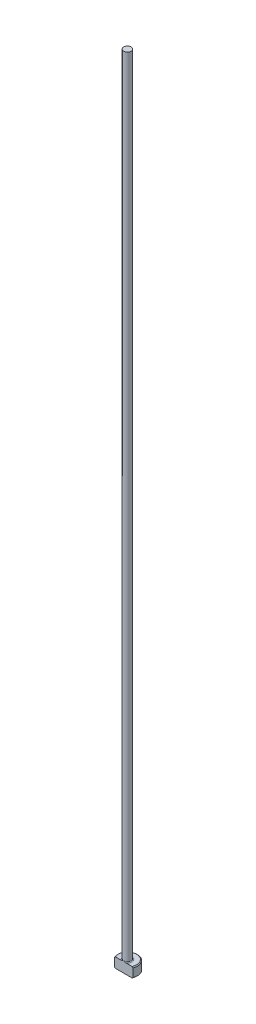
ISO-10303-21;
HEADER;
FILE_DESCRIPTION(('STEP AP214'),'2;1');
FILE_NAME('part.step','',(''),(''),'','','');
FILE_SCHEMA(('AUTOMOTIVE_DESIGN { 1 0 10303 214 1 1 1 1 }'));
ENDSEC;
DATA;
#1=APPLICATION_CONTEXT('core data for automotive mechanical design processes');
#2=APPLICATION_PROTOCOL_DEFINITION('international standard','automotive_design',2000,#1);
#3=PRODUCT_CONTEXT('',#1,'mechanical');
#4=PRODUCT('Part','Part','',(#3));
#5=PRODUCT_RELATED_PRODUCT_CATEGORY('part','',(#4));
#6=PRODUCT_DEFINITION_FORMATION('','',#4);
#7=PRODUCT_DEFINITION_CONTEXT('part definition',#1,'design');
#8=PRODUCT_DEFINITION('design','',#6,#7);
#9=PRODUCT_DEFINITION_SHAPE('','',#8);
#10=(LENGTH_UNIT() NAMED_UNIT(*) SI_UNIT(.MILLI.,.METRE.));
#11=(NAMED_UNIT(*) PLANE_ANGLE_UNIT() SI_UNIT($,.RADIAN.));
#12=(NAMED_UNIT(*) SI_UNIT($,.STERADIAN.) SOLID_ANGLE_UNIT());
#13=UNCERTAINTY_MEASURE_WITH_UNIT(LENGTH_MEASURE(1.E-05),#10,'distance_accuracy_value','');
#14=(GEOMETRIC_REPRESENTATION_CONTEXT(3) GLOBAL_UNCERTAINTY_ASSIGNED_CONTEXT((#13)) GLOBAL_UNIT_ASSIGNED_CONTEXT((#10,
#11,#12)) REPRESENTATION_CONTEXT('',''));
#15=CARTESIAN_POINT('',(0.,0.,0.));
#16=DIRECTION('',(0.,0.,1.));
#17=DIRECTION('',(1.,0.,0.));
#18=AXIS2_PLACEMENT_3D('',#15,#16,#17);
#19=CARTESIAN_POINT('',(0.,0.,0.));
#20=DIRECTION('',(0.,-1.,0.));
#21=DIRECTION('',(0.,0.,-1.));
#22=AXIS2_PLACEMENT_3D('',#19,#20,#21);
#23=PLANE('',#22);
#24=CARTESIAN_POINT('',(0.,0.,0.));
#25=DIRECTION('',(0.,-1.,0.));
#26=DIRECTION('',(0.,0.,-1.));
#27=AXIS2_PLACEMENT_3D('',#24,#25,#26);
#28=CIRCLE('',#27,2.92099999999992);
#29=CARTESIAN_POINT('',(-2.66761406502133,0.,1.18998999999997));
#30=VERTEX_POINT('',#29);
#31=CARTESIAN_POINT('',(2.66761406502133,0.,1.18998999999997));
#32=VERTEX_POINT('',#31);
#33=EDGE_CURVE('E98',#30,#32,#28,.T.);
#34=ORIENTED_EDGE('',*,*,#33,.T.);
#35=DIRECTION('',(-1.,0.,0.));
#36=VECTOR('',#35,1.);
#37=CARTESIAN_POINT('',(-2.94356056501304,0.,1.18998999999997));
#38=LINE('',#37,#36);
#39=EDGE_CURVE('E83',#32,#30,#38,.T.);
#40=ORIENTED_EDGE('',*,*,#39,.T.);
#41=EDGE_LOOP('',(#34,#40));
#42=FACE_BOUND('',#41,.T.);
#43=ADVANCED_FACE('F32',(#42),#23,.T.);
#44=CARTESIAN_POINT('',(0.,259.958771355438,0.));
#45=DIRECTION('',(0.,1.,0.));
#46=DIRECTION('',(0.,0.,1.));
#47=AXIS2_PLACEMENT_3D('',#44,#45,#46);
#48=CYLINDRICAL_SURFACE('',#47,3.17499999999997);
#49=CARTESIAN_POINT('',(0.,2.92100000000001,0.));
#50=DIRECTION('',(0.,1.,0.));
#51=DIRECTION('',(0.,0.,1.));
#52=AXIS2_PLACEMENT_3D('',#49,#50,#51);
#53=CIRCLE('',#52,3.17499999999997);
#54=CARTESIAN_POINT('',(-2.94356056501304,2.92100000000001,1.18998999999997));
#55=VERTEX_POINT('',#54);
#56=CARTESIAN_POINT('',(2.94356056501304,2.92100000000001,1.18998999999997));
#57=VERTEX_POINT('',#56);
#58=EDGE_CURVE('E104',#55,#57,#53,.F.);
#59=ORIENTED_EDGE('',*,*,#58,.T.);
#60=DIRECTION('',(0.,-1.,0.));
#61=VECTOR('',#60,1.);
#62=CARTESIAN_POINT('',(2.94356056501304,254.,1.18998999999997));
#63=LINE('',#62,#61);
#64=CARTESIAN_POINT('',(2.94356056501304,0.254000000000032,1.18998999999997));
#65=VERTEX_POINT('',#64);
#66=EDGE_CURVE('E183',#57,#65,#63,.T.);
#67=ORIENTED_EDGE('',*,*,#66,.T.);
#68=CARTESIAN_POINT('',(0.,0.254000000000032,0.));
#69=DIRECTION('',(0.,-1.,0.));
#70=DIRECTION('',(0.,0.,-1.));
#71=AXIS2_PLACEMENT_3D('',#68,#69,#70);
#72=CIRCLE('',#71,3.17499999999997);
#73=CARTESIAN_POINT('',(-2.94356056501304,0.254000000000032,1.18998999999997));
#74=VERTEX_POINT('',#73);
#75=EDGE_CURVE('E100',#65,#74,#72,.F.);
#76=ORIENTED_EDGE('',*,*,#75,.T.);
#77=DIRECTION('',(0.,-1.,0.));
#78=VECTOR('',#77,1.);
#79=CARTESIAN_POINT('',(-2.94356056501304,254.,1.18998999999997));
#80=LINE('',#79,#78);
#81=EDGE_CURVE('E93',#55,#74,#80,.T.);
#82=ORIENTED_EDGE('',*,*,#81,.F.);
#83=EDGE_LOOP('',(#59,#67,#76,#82));
#84=FACE_BOUND('',#83,.T.);
#85=ADVANCED_FACE('F158',(#84),#48,.T.);
#86=CARTESIAN_POINT('',(-3.17499999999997,3.175,0.));
#87=DIRECTION('',(0.,1.,0.));
#88=DIRECTION('',(0.,0.,1.));
#89=AXIS2_PLACEMENT_3D('',#86,#87,#88);
#90=PLANE('',#89);
#91=CARTESIAN_POINT('',(0.,3.175,0.));
#92=DIRECTION('',(0.,1.,0.));
#93=DIRECTION('',(0.,0.,1.));
#94=AXIS2_PLACEMENT_3D('',#91,#92,#93);
#95=CIRCLE('',#94,2.92099999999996);
#96=CARTESIAN_POINT('',(2.66761406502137,3.175,1.18998999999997));
#97=VERTEX_POINT('',#96);
#98=CARTESIAN_POINT('',(-2.66761406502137,3.175,1.18998999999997));
#99=VERTEX_POINT('',#98);
#100=EDGE_CURVE('E178',#97,#99,#95,.T.);
#101=ORIENTED_EDGE('',*,*,#100,.T.);
#102=DIRECTION('',(1.,0.,0.));
#103=VECTOR('',#102,1.);
#104=CARTESIAN_POINT('',(-3.17499999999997,3.175,1.18998999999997));
#105=LINE('',#104,#103);
#106=CARTESIAN_POINT('',(-0.817943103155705,3.17500000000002,1.18998999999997));
#107=VERTEX_POINT('',#106);
#108=EDGE_CURVE('E57',#99,#107,#105,.T.);
#109=ORIENTED_EDGE('',*,*,#108,.T.);
#110=CARTESIAN_POINT('',(0.,3.175,0.));
#111=DIRECTION('',(0.,1.,0.));
#112=DIRECTION('',(0.,0.,1.));
#113=AXIS2_PLACEMENT_3D('',#110,#111,#112);
#114=CIRCLE('',#113,1.44398999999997);
#115=CARTESIAN_POINT('',(0.817943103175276,3.17500000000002,1.18998999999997));
#116=VERTEX_POINT('',#115);
#117=EDGE_CURVE('E107',#107,#116,#114,.F.);
#118=ORIENTED_EDGE('',*,*,#117,.T.);
#119=EDGE_CURVE('E136',#116,#97,#105,.T.);
#120=ORIENTED_EDGE('',*,*,#119,.T.);
#121=EDGE_LOOP('',(#101,#109,#118,#120));
#122=FACE_BOUND('',#121,.T.);
#123=ADVANCED_FACE('F147',(#122),#90,.T.);
#124=CARTESIAN_POINT('',(0.,3.17499999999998,0.));
#125=DIRECTION('',(0.,-1.,0.));
#126=DIRECTION('',(0.,0.,-1.));
#127=AXIS2_PLACEMENT_3D('',#124,#125,#126);
#128=CONICAL_SURFACE('',#127,2.92099999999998,0.785398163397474);
#129=ORIENTED_EDGE('',*,*,#58,.F.);
#130=CARTESIAN_POINT('',(-6.47931936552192,-0.49168970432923,1.18998999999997));
#131=CARTESIAN_POINT('',(-6.3057518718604,-0.3209865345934,1.18998999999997));
#132=CARTESIAN_POINT('',(-6.13208094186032,-0.150388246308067,1.18998999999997));
#133=CARTESIAN_POINT('',(-5.78425276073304,0.190708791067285,1.18998999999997));
#134=CARTESIAN_POINT('',(-5.610095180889,0.361207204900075,1.18998999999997));
#135=CARTESIAN_POINT('',(-5.25789988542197,0.705253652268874,1.18998999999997));
#136=CARTESIAN_POINT('',(-5.07985463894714,0.878793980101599,1.18998999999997));
#137=CARTESIAN_POINT('',(-4.72344726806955,1.22514212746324,1.18998999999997));
#138=CARTESIAN_POINT('',(-4.54508573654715,1.39795055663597,1.18998999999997));
#139=CARTESIAN_POINT('',(-4.22178053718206,1.709878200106,1.18998999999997));
#140=CARTESIAN_POINT('',(-4.07696186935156,1.84912689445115,1.18998999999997));
#141=CARTESIAN_POINT('',(-3.78666752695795,2.12697558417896,1.18998999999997));
#142=CARTESIAN_POINT('',(-3.64119177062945,2.26557549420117,1.18998999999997));
#143=CARTESIAN_POINT('',(-3.34872942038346,2.54243487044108,1.18998999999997));
#144=CARTESIAN_POINT('',(-3.20173902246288,2.68069032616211,1.18998999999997));
#145=CARTESIAN_POINT('',(-2.90653907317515,2.95574973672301,1.18998999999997));
#146=CARTESIAN_POINT('',(-2.75833015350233,3.09255436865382,1.18998999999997));
#147=CARTESIAN_POINT('',(-2.46256150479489,3.36167470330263,1.18998999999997));
#148=CARTESIAN_POINT('',(-2.3150353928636,3.49402709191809,1.18998999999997));
#149=CARTESIAN_POINT('',(-2.09131974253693,3.69008529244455,1.18998999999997));
#150=CARTESIAN_POINT('',(-2.01626900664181,3.75508852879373,1.18998999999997));
#151=CARTESIAN_POINT('',(-1.86516644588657,3.88390741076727,1.18998999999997));
#152=CARTESIAN_POINT('',(-1.78911473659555,3.94772319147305,1.18998999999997));
#153=CARTESIAN_POINT('',(-1.63628476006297,4.07322581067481,1.18998999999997));
#154=CARTESIAN_POINT('',(-1.55951715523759,4.13492558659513,1.18998999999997));
#155=CARTESIAN_POINT('',(-1.40419805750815,4.25603341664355,1.18998999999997));
#156=CARTESIAN_POINT('',(-1.32564684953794,4.31544183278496,1.18998999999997));
#157=CARTESIAN_POINT('',(-1.16630337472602,4.43067355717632,1.18998999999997));
#158=CARTESIAN_POINT('',(-1.0855185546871,4.48650710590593,1.18998999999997));
#159=CARTESIAN_POINT('',(-0.920537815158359,4.59284659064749,1.18998999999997));
#160=CARTESIAN_POINT('',(-0.836346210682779,4.64335899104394,1.18998999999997));
#161=CARTESIAN_POINT('',(-0.730888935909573,4.69956746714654,1.18998999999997));
#162=CARTESIAN_POINT('',(-0.71184810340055,4.70944634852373,1.18998999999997));
#163=CARTESIAN_POINT('',(-0.673521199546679,4.72872851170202,1.18998999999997));
#164=CARTESIAN_POINT('',(-0.654235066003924,4.73813166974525,1.18998999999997));
#165=CARTESIAN_POINT('',(-0.59599952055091,4.7655420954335,1.18998999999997));
#166=CARTESIAN_POINT('',(-0.556668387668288,4.78275278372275,1.18998999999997));
#167=CARTESIAN_POINT('',(-0.477355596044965,4.81434640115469,1.18998999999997));
#168=CARTESIAN_POINT('',(-0.437385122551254,4.82875715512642,1.18998999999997));
#169=CARTESIAN_POINT('',(-0.356410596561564,4.85437528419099,1.18998999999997));
#170=CARTESIAN_POINT('',(-0.31540652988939,4.86558261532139,1.18998999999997));
#171=CARTESIAN_POINT('',(-0.239749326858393,4.88255703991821,1.18998999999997));
#172=CARTESIAN_POINT('',(-0.205233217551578,4.88893154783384,1.18998999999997));
#173=CARTESIAN_POINT('',(-0.135794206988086,4.89877967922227,1.18998999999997));
#174=CARTESIAN_POINT('',(-0.100871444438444,4.90225426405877,1.18998999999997));
#175=CARTESIAN_POINT('',(-0.0309424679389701,4.9061183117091,1.18998999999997));
#176=CARTESIAN_POINT('',(0.00406330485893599,4.90651563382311,1.18998999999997));
#177=CARTESIAN_POINT('',(0.0739860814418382,4.90422492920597,1.18998999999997));
#178=CARTESIAN_POINT('',(0.108903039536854,4.90153554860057,1.18998999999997));
#179=CARTESIAN_POINT('',(0.185811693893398,4.89231772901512,1.18998999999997));
#180=CARTESIAN_POINT('',(0.227719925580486,4.88509144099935,1.18998999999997));
#181=CARTESIAN_POINT('',(0.310690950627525,4.86678744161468,1.18998999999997));
#182=CARTESIAN_POINT('',(0.351753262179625,4.85570759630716,1.18998999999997));
#183=CARTESIAN_POINT('',(0.433130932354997,4.83023017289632,1.18998999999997));
#184=CARTESIAN_POINT('',(0.473439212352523,4.81581030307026,1.18998999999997));
#185=CARTESIAN_POINT('',(0.552977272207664,4.78431092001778,1.18998999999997));
#186=CARTESIAN_POINT('',(0.592207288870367,4.76723199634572,1.18998999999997));
#187=CARTESIAN_POINT('',(0.705140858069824,4.71434057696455,1.18998999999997));
#188=CARTESIAN_POINT('',(0.777512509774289,4.67569611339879,1.18998999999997));
#189=CARTESIAN_POINT('',(0.919347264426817,4.59335368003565,1.18998999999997));
#190=CARTESIAN_POINT('',(0.988806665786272,4.5496495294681,1.18998999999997));
#191=CARTESIAN_POINT('',(1.12574256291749,4.4587011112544,1.18998999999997));
#192=CARTESIAN_POINT('',(1.19321018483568,4.41144359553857,1.18998999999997));
#193=CARTESIAN_POINT('',(1.32639871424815,4.31461731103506,1.18998999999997));
#194=CARTESIAN_POINT('',(1.39212046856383,4.26504969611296,1.18998999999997));
#195=CARTESIAN_POINT('',(1.52321682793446,4.16350825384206,1.18998999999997));
#196=CARTESIAN_POINT('',(1.58857229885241,4.11150983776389,1.18998999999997));
#197=CARTESIAN_POINT('',(1.71826265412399,4.00624640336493,1.18998999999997));
#198=CARTESIAN_POINT('',(1.78259742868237,3.95298125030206,1.18998999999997));
#199=CARTESIAN_POINT('',(1.9103046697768,3.84563387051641,1.18998999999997));
#200=CARTESIAN_POINT('',(1.97367914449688,3.79155402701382,1.18998999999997));
#201=CARTESIAN_POINT('',(2.09979151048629,3.68266386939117,1.18998999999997));
#202=CARTESIAN_POINT('',(2.1625294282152,3.62785358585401,1.18998999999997));
#203=CARTESIAN_POINT('',(2.32034022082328,3.48869772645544,1.18998999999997));
#204=CARTESIAN_POINT('',(2.41507621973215,3.40397040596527,1.18998999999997));
#205=CARTESIAN_POINT('',(2.60367921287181,3.23355294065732,1.18998999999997));
#206=CARTESIAN_POINT('',(2.69754618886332,3.14786277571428,1.18998999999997));
#207=CARTESIAN_POINT('',(2.97818594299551,2.88972120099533,1.18998999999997));
#208=CARTESIAN_POINT('',(3.1639838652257,2.71621092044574,1.18998999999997));
#209=CARTESIAN_POINT('',(3.53424564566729,2.36730235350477,1.18998999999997));
#210=CARTESIAN_POINT('',(3.71870746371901,2.19190191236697,1.18998999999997));
#211=CARTESIAN_POINT('',(4.08658256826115,1.84002104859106,1.18998999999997));
#212=CARTESIAN_POINT('',(4.26999589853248,1.6635406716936,1.18998999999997));
#213=CARTESIAN_POINT('',(4.62290911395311,1.32258886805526,1.18998999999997));
#214=CARTESIAN_POINT('',(4.79245879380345,1.15816891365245,1.18998999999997));
#215=CARTESIAN_POINT('',(5.13110594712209,0.828859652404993,1.18998999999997));
#216=CARTESIAN_POINT('',(5.30020341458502,0.663970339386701,1.18998999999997));
#217=CARTESIAN_POINT('',(5.63778854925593,0.334103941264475,1.18998999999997));
#218=CARTESIAN_POINT('',(5.80627675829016,0.169127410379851,1.18998999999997));
#219=CARTESIAN_POINT('',(6.14298232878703,-0.161096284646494,1.18998999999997));
#220=CARTESIAN_POINT('',(6.31119969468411,-0.32634344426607,1.18998999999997));
#221=CARTESIAN_POINT('',(6.47931936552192,-0.49168970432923,1.18998999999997));
#222=B_SPLINE_CURVE_WITH_KNOTS('',3,(#130,#131,#132,#133,#134,#135,#136,#137,#138,#139,#140,
#141,#142,#143,#144,#145,#146,#147,#148,#149,#150,#151,#152,#153,#154,#155,#156,#157,#158,#159,
#160,#161,#162,#163,#164,#165,#166,#167,#168,#169,#170,#171,#172,#173,#174,#175,#176,#177,#178,
#179,#180,#181,#182,#183,#184,#185,#186,#187,#188,#189,#190,#191,#192,#193,#194,#195,#196,#197,
#198,#199,#200,#201,#202,#203,#204,#205,#206,#207,#208,#209,#210,#211,#212,#213,#214,#215,#216,
#217,#218,#219,#220,#221),.UNSPECIFIED.,.F.,.F.,(4,2,2,2,2,2,2,2,2,2,2,2,2,2,2,2,2,2,2,2,2,2,2,
2,2,2,2,2,2,2,2,2,2,2,2,2,2,2,2,2,2,2,2,2,2,4),(0.,0.730333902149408,1.46150049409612,
2.20738656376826,2.95242206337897,3.55513421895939,4.15792356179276,4.76329855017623,
5.3683773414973,5.96292222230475,6.26077664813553,6.55859698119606,6.85403741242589,
7.14943097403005,7.44393654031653,7.7380800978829,7.80242723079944,7.866791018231,
7.99550301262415,8.12286192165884,8.25022257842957,8.35541203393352,8.46056660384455,
8.56545252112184,8.67038446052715,8.79775050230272,8.92518718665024,9.05350023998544,
9.18178488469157,9.4275558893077,9.67363035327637,9.92067269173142,10.1675929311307,
10.4181243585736,10.6686825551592,10.9186125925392,11.1685321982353,11.5498128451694,
11.9311014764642,12.6937337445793,13.4573540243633,14.2209421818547,14.9294812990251,
15.638029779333,16.3454542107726,17.0528669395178),.UNSPECIFIED.);
#223=EDGE_CURVE('E135',#55,#99,#222,.T.);
#224=ORIENTED_EDGE('',*,*,#223,.T.);
#225=ORIENTED_EDGE('',*,*,#100,.F.);
#226=EDGE_CURVE('E127',#97,#57,#222,.T.);
#227=ORIENTED_EDGE('',*,*,#226,.T.);
#228=EDGE_LOOP('',(#129,#224,#225,#227));
#229=FACE_BOUND('',#228,.T.);
#230=ADVANCED_FACE('F143',(#229),#128,.T.);
#231=CARTESIAN_POINT('',(0.,0.254000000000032,0.));
#232=DIRECTION('',(0.,1.,0.));
#233=DIRECTION('',(0.,0.,1.));
#234=AXIS2_PLACEMENT_3D('',#231,#232,#233);
#235=CONICAL_SURFACE('',#234,3.17499999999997,0.785398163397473);
#236=ORIENTED_EDGE('',*,*,#75,.F.);
#237=CARTESIAN_POINT('',(6.47931936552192,3.66668970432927,1.18998999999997));
#238=CARTESIAN_POINT('',(6.3057518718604,3.49598653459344,1.18998999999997));
#239=CARTESIAN_POINT('',(6.13208094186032,3.32538824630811,1.18998999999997));
#240=CARTESIAN_POINT('',(5.78425276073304,2.98429120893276,1.18998999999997));
#241=CARTESIAN_POINT('',(5.610095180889,2.81379279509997,1.18998999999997));
#242=CARTESIAN_POINT('',(5.25789988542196,2.46974634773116,1.18998999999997));
#243=CARTESIAN_POINT('',(5.07985463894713,2.29620601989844,1.18998999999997));
#244=CARTESIAN_POINT('',(4.72344726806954,1.9498578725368,1.18998999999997));
#245=CARTESIAN_POINT('',(4.54508573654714,1.77704944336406,1.18998999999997));
#246=CARTESIAN_POINT('',(4.22178053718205,1.46512179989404,1.18998999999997));
#247=CARTESIAN_POINT('',(4.07696186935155,1.32587310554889,1.18998999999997));
#248=CARTESIAN_POINT('',(3.78666752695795,1.04802441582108,1.18998999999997));
#249=CARTESIAN_POINT('',(3.64119177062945,0.909424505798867,1.18998999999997));
#250=CARTESIAN_POINT('',(3.34872942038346,0.632565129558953,1.18998999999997));
#251=CARTESIAN_POINT('',(3.20173902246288,0.494309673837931,1.18998999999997));
#252=CARTESIAN_POINT('',(2.90653907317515,0.219250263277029,1.18998999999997));
#253=CARTESIAN_POINT('',(2.75833015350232,0.0824456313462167,1.18998999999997));
#254=CARTESIAN_POINT('',(2.46256150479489,-0.186674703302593,1.18998999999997));
#255=CARTESIAN_POINT('',(2.3150353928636,-0.319027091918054,1.18998999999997));
#256=CARTESIAN_POINT('',(2.09131974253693,-0.515085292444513,1.18998999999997));
#257=CARTESIAN_POINT('',(2.01626900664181,-0.580088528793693,1.18998999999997));
#258=CARTESIAN_POINT('',(1.86516644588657,-0.708907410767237,1.18998999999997));
#259=CARTESIAN_POINT('',(1.78911473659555,-0.77272319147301,1.18998999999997));
#260=CARTESIAN_POINT('',(1.63628476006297,-0.898225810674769,1.18998999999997));
#261=CARTESIAN_POINT('',(1.55951715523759,-0.959925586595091,1.18998999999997));
#262=CARTESIAN_POINT('',(1.40419805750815,-1.08103341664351,1.18998999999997));
#263=CARTESIAN_POINT('',(1.32564684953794,-1.14044183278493,1.18998999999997));
#264=CARTESIAN_POINT('',(1.16630337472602,-1.25567355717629,1.18998999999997));
#265=CARTESIAN_POINT('',(1.0855185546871,-1.31150710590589,1.18998999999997));
#266=CARTESIAN_POINT('',(0.920537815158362,-1.41784659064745,1.18998999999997));
#267=CARTESIAN_POINT('',(0.836346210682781,-1.4683589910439,1.18998999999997));
#268=CARTESIAN_POINT('',(0.730888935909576,-1.5245674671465,1.18998999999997));
#269=CARTESIAN_POINT('',(0.711848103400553,-1.53444634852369,1.18998999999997));
#270=CARTESIAN_POINT('',(0.673521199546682,-1.55372851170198,1.18998999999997));
#271=CARTESIAN_POINT('',(0.654235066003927,-1.56313166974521,1.18998999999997));
#272=CARTESIAN_POINT('',(0.595999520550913,-1.59054209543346,1.18998999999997));
#273=CARTESIAN_POINT('',(0.556668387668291,-1.60775278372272,1.18998999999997));
#274=CARTESIAN_POINT('',(0.477355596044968,-1.63934640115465,1.18998999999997));
#275=CARTESIAN_POINT('',(0.437385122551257,-1.65375715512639,1.18998999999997));
#276=CARTESIAN_POINT('',(0.356410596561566,-1.67937528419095,1.18998999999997));
#277=CARTESIAN_POINT('',(0.315406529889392,-1.69058261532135,1.18998999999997));
#278=CARTESIAN_POINT('',(0.239749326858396,-1.70755703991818,1.18998999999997));
#279=CARTESIAN_POINT('',(0.205233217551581,-1.7139315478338,1.18998999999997));
#280=CARTESIAN_POINT('',(0.13579420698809,-1.72377967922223,1.18998999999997));
#281=CARTESIAN_POINT('',(0.100871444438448,-1.72725426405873,1.18998999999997));
#282=CARTESIAN_POINT('',(0.0309424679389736,-1.73111831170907,1.18998999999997));
#283=CARTESIAN_POINT('',(-0.00406330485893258,-1.73151563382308,1.18998999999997));
#284=CARTESIAN_POINT('',(-0.073986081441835,-1.72922492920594,1.18998999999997));
#285=CARTESIAN_POINT('',(-0.108903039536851,-1.72653554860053,1.18998999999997));
#286=CARTESIAN_POINT('',(-0.185811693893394,-1.71731772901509,1.18998999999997));
#287=CARTESIAN_POINT('',(-0.227719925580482,-1.71009144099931,1.18998999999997));
#288=CARTESIAN_POINT('',(-0.31069095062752,-1.69178744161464,1.18998999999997));
#289=CARTESIAN_POINT('',(-0.351753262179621,-1.68070759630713,1.18998999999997));
#290=CARTESIAN_POINT('',(-0.433130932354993,-1.65523017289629,1.18998999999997));
#291=CARTESIAN_POINT('',(-0.473439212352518,-1.64081030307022,1.18998999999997));
#292=CARTESIAN_POINT('',(-0.55297727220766,-1.60931092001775,1.18998999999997));
#293=CARTESIAN_POINT('',(-0.592207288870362,-1.59223199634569,1.18998999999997));
#294=CARTESIAN_POINT('',(-0.705140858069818,-1.53934057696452,1.18998999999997));
#295=CARTESIAN_POINT('',(-0.777512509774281,-1.50069611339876,1.18998999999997));
#296=CARTESIAN_POINT('',(-0.919347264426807,-1.41835368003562,1.18998999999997));
#297=CARTESIAN_POINT('',(-0.988806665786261,-1.37464952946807,1.18998999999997));
#298=CARTESIAN_POINT('',(-1.12574256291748,-1.28370111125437,1.18998999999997));
#299=CARTESIAN_POINT('',(-1.19321018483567,-1.23644359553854,1.18998999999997));
#300=CARTESIAN_POINT('',(-1.32639871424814,-1.13961731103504,1.18998999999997));
#301=CARTESIAN_POINT('',(-1.39212046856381,-1.09004969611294,1.18998999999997));
#302=CARTESIAN_POINT('',(-1.52321682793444,-0.988508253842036,1.18998999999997));
#303=CARTESIAN_POINT('',(-1.58857229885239,-0.936509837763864,1.18998999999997));
#304=CARTESIAN_POINT('',(-1.71826265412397,-0.831246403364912,1.18998999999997));
#305=CARTESIAN_POINT('',(-1.78259742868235,-0.777981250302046,1.18998999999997));
#306=CARTESIAN_POINT('',(-1.91030466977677,-0.670633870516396,1.18998999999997));
#307=CARTESIAN_POINT('',(-1.97367914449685,-0.616554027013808,1.18998999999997));
#308=CARTESIAN_POINT('',(-2.09979151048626,-0.507663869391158,1.18998999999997));
#309=CARTESIAN_POINT('',(-2.16252942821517,-0.452853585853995,1.18998999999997));
#310=CARTESIAN_POINT('',(-2.32034022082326,-0.313697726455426,1.18998999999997));
#311=CARTESIAN_POINT('',(-2.41507621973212,-0.228970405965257,1.18998999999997));
#312=CARTESIAN_POINT('',(-2.60367921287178,-0.0585529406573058,1.18998999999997));
#313=CARTESIAN_POINT('',(-2.69754618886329,0.0271372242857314,1.18998999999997));
#314=CARTESIAN_POINT('',(-2.97818594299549,0.28527879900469,1.18998999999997));
#315=CARTESIAN_POINT('',(-3.16398386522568,0.458789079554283,1.18998999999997));
#316=CARTESIAN_POINT('',(-3.53424564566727,0.80769764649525,1.18998999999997));
#317=CARTESIAN_POINT('',(-3.71870746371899,0.98309808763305,1.18998999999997));
#318=CARTESIAN_POINT('',(-4.08658256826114,1.33497895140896,1.18998999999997));
#319=CARTESIAN_POINT('',(-4.26999589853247,1.51145932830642,1.18998999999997));
#320=CARTESIAN_POINT('',(-4.6229091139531,1.85241113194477,1.18998999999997));
#321=CARTESIAN_POINT('',(-4.79245879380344,2.01683108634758,1.18998999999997));
#322=CARTESIAN_POINT('',(-5.13110594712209,2.34614034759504,1.18998999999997));
#323=CARTESIAN_POINT('',(-5.30020341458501,2.51102966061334,1.18998999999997));
#324=CARTESIAN_POINT('',(-5.63778854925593,2.84089605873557,1.18998999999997));
#325=CARTESIAN_POINT('',(-5.80627675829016,3.00587258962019,1.18998999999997));
#326=CARTESIAN_POINT('',(-6.14298232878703,3.33609628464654,1.18998999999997));
#327=CARTESIAN_POINT('',(-6.31119969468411,3.50134344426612,1.18998999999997));
#328=CARTESIAN_POINT('',(-6.47931936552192,3.66668970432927,1.18998999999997));
#329=B_SPLINE_CURVE_WITH_KNOTS('',3,(#237,#238,#239,#240,#241,#242,#243,#244,#245,#246,#247,
#248,#249,#250,#251,#252,#253,#254,#255,#256,#257,#258,#259,#260,#261,#262,#263,#264,#265,#266,
#267,#268,#269,#270,#271,#272,#273,#274,#275,#276,#277,#278,#279,#280,#281,#282,#283,#284,#285,
#286,#287,#288,#289,#290,#291,#292,#293,#294,#295,#296,#297,#298,#299,#300,#301,#302,#303,#304,
#305,#306,#307,#308,#309,#310,#311,#312,#313,#314,#315,#316,#317,#318,#319,#320,#321,#322,#323,
#324,#325,#326,#327,#328),.UNSPECIFIED.,.F.,.F.,(4,2,2,2,2,2,2,2,2,2,2,2,2,2,2,2,2,2,2,2,2,2,2,
2,2,2,2,2,2,2,2,2,2,2,2,2,2,2,2,2,2,2,2,2,2,4),(0.,0.730333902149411,1.46150049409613,
2.20738656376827,2.95242206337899,3.5551342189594,4.15792356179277,4.76329855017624,
5.36837734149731,5.96292222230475,6.26077664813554,6.55859698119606,6.85403741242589,
7.14943097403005,7.44393654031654,7.7380800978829,7.80242723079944,7.866791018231,
7.99550301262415,8.12286192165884,8.25022257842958,8.35541203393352,8.46056660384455,
8.56545252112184,8.67038446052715,8.79775050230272,8.92518718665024,9.05350023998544,
9.18178488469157,9.42755588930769,9.67363035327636,9.92067269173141,10.1675929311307,
10.4181243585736,10.6686825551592,10.9186125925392,11.1685321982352,11.5498128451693,
11.9311014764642,12.6937337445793,13.4573540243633,14.2209421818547,14.9294812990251,
15.638029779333,16.3454542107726,17.0528669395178),.UNSPECIFIED.);
#330=EDGE_CURVE('E86',#65,#32,#329,.T.);
#331=ORIENTED_EDGE('',*,*,#330,.T.);
#332=ORIENTED_EDGE('',*,*,#33,.F.);
#333=EDGE_CURVE('E89',#30,#74,#329,.T.);
#334=ORIENTED_EDGE('',*,*,#333,.T.);
#335=EDGE_LOOP('',(#236,#331,#332,#334));
#336=FACE_BOUND('',#335,.T.);
#337=ADVANCED_FACE('F97',(#336),#235,.T.);
#338=CARTESIAN_POINT('',(0.,3.42900000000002,0.));
#339=DIRECTION('',(0.,1.,0.));
#340=DIRECTION('',(0.,0.,1.));
#341=AXIS2_PLACEMENT_3D('',#338,#339,#340);
#342=TOROIDAL_SURFACE('',#341,1.44398999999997,0.254);
#343=CARTESIAN_POINT('',(0.,3.42900000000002,1.18998999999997));
#344=CARTESIAN_POINT('',(1.26788799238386E-12,3.42900058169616,1.18998999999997));
#345=CARTESIAN_POINT('',(1.02037080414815E-07,3.42900116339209,1.18998999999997));
#346=CARTESIAN_POINT('',(4.36423738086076E-07,3.42900229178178,1.18998999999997));
#347=CARTESIAN_POINT('',(6.7104077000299E-07,3.42900283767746,1.18998999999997));
#348=CARTESIAN_POINT('',(1.23856841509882E-06,3.42900392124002,1.18998999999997));
#349=CARTESIAN_POINT('',(1.57695860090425E-06,3.42900445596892,1.18998999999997));
#350=CARTESIAN_POINT('',(2.31458772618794E-06,3.42900547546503,1.18998999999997));
#351=CARTESIAN_POINT('',(2.71349856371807E-06,3.42900596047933,1.18998999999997));
#352=CARTESIAN_POINT('',(4.11884078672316E-06,3.42900754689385,1.18998999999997));
#353=CARTESIAN_POINT('',(5.20568846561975E-06,3.42900857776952,1.18998999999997));
#354=CARTESIAN_POINT('',(7.47790847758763E-06,3.4290104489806,1.18998999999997));
#355=CARTESIAN_POINT('',(8.65996322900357E-06,3.4290112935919,1.18998999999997));
#356=CARTESIAN_POINT('',(1.31663854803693E-05,3.42901436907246,1.18998999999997));
#357=CARTESIAN_POINT('',(1.6609768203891E-05,3.42901643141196,1.18998999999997));
#358=CARTESIAN_POINT('',(2.34843039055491E-05,3.42901989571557,1.18998999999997));
#359=CARTESIAN_POINT('',(2.68971573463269E-05,3.42902133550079,1.18998999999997));
#360=CARTESIAN_POINT('',(4.11260389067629E-05,3.42902727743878,1.18998999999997));
#361=CARTESIAN_POINT('',(5.19833878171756E-05,3.42903166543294,1.18998999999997));
#362=CARTESIAN_POINT('',(7.24910575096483E-05,3.42903888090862,1.18998999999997));
#363=CARTESIAN_POINT('',(8.20928106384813E-05,3.42904184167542,1.18998999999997));
#364=CARTESIAN_POINT('',(0.000150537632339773,3.42906480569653,1.18998999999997));
#365=CARTESIAN_POINT('',(0.000206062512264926,3.42909344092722,1.18998999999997));
#366=CARTESIAN_POINT('',(0.000420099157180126,3.42919967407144,1.18998999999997));
#367=CARTESIAN_POINT('',(0.000580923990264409,3.42927086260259,1.18998999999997));
#368=CARTESIAN_POINT('',(0.0011986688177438,3.42954850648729,1.18998999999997));
#369=CARTESIAN_POINT('',(0.00165320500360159,3.42976167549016,1.18998999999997));
#370=CARTESIAN_POINT('',(0.00349115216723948,3.43061934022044,1.18998999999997));
#371=CARTESIAN_POINT('',(0.00487719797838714,3.43125630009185,1.18998999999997));
#372=CARTESIAN_POINT('',(0.0272455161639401,3.44154091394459,1.18998999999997));
#373=CARTESIAN_POINT('',(0.0482060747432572,3.45125229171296,1.18998999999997));
#374=CARTESIAN_POINT('',(0.0894544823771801,3.47019581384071,1.18998999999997));
#375=CARTESIAN_POINT('',(0.109740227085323,3.47943284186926,1.18998999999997));
#376=CARTESIAN_POINT('',(0.152645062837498,3.49874471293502,1.18998999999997));
#377=CARTESIAN_POINT('',(0.17527359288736,3.50879895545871,1.18998999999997));
#378=CARTESIAN_POINT('',(0.220904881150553,3.52864652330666,1.18998999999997));
#379=CARTESIAN_POINT('',(0.243909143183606,3.53843639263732,1.18998999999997));
#380=CARTESIAN_POINT('',(0.301812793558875,3.56234769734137,1.18998999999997));
#381=CARTESIAN_POINT('',(0.336843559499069,3.57615550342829,1.18998999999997));
#382=CARTESIAN_POINT('',(0.406753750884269,3.60184766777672,1.18998999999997));
#383=CARTESIAN_POINT('',(0.441620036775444,3.61376719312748,1.18998999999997));
#384=CARTESIAN_POINT('',(0.50021476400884,3.63181866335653,1.18998999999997));
#385=CARTESIAN_POINT('',(0.523756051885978,3.63855079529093,1.18998999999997));
#386=CARTESIAN_POINT('',(0.571256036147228,3.65089320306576,1.18998999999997));
#387=CARTESIAN_POINT('',(0.595216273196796,3.65649741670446,1.18998999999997));
#388=CARTESIAN_POINT('',(0.669974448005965,3.6717221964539,1.18998999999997));
#389=CARTESIAN_POINT('',(0.721326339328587,3.67898748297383,1.18998999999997));
#390=CARTESIAN_POINT('',(0.80486783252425,3.68348474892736,1.18998999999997));
#391=CARTESIAN_POINT('',(0.836903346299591,3.6834849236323,1.18998999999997));
#392=CARTESIAN_POINT('',(0.900349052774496,3.67912359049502,1.18998999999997));
#393=CARTESIAN_POINT('',(0.931762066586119,3.67481634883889,1.18998999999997));
#394=CARTESIAN_POINT('',(0.98360843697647,3.66299454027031,1.18998999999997));
#395=CARTESIAN_POINT('',(1.00436819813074,3.65692785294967,1.18998999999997));
#396=CARTESIAN_POINT('',(1.04483432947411,3.64179163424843,1.18998999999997));
#397=CARTESIAN_POINT('',(1.06453980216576,3.63271959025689,1.18998999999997));
#398=CARTESIAN_POINT('',(1.09672199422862,3.61416783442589,1.18998999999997));
#399=CARTESIAN_POINT('',(1.10967469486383,3.60551806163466,1.18998999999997));
#400=CARTESIAN_POINT('',(1.13407930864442,3.58631142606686,1.18998999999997));
#401=CARTESIAN_POINT('',(1.1455339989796,3.57575818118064,1.18998999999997));
#402=CARTESIAN_POINT('',(1.16408929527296,3.555205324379,1.18998999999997));
#403=CARTESIAN_POINT('',(1.17159652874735,3.54557455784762,1.18998999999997));
#404=CARTESIAN_POINT('',(1.18494613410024,3.52520962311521,1.18998999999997));
#405=CARTESIAN_POINT('',(1.19078913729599,3.51447587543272,1.18998999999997));
#406=CARTESIAN_POINT('',(1.20047872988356,3.4920216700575,1.18998999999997));
#407=CARTESIAN_POINT('',(1.20430808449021,3.48029366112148,1.18998999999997));
#408=CARTESIAN_POINT('',(1.20958011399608,3.45631266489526,1.18998999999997));
#409=CARTESIAN_POINT('',(1.2110249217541,3.44406015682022,1.18998999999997));
#410=CARTESIAN_POINT('',(1.21137893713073,3.42120864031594,1.18998999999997));
#411=CARTESIAN_POINT('',(1.21060887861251,3.41061344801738,1.18998999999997));
#412=CARTESIAN_POINT('',(1.20725809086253,3.3897162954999,1.18998999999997));
#413=CARTESIAN_POINT('',(1.20467751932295,3.37941430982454,1.18998999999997));
#414=CARTESIAN_POINT('',(1.19793821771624,3.35957884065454,1.18998999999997));
#415=CARTESIAN_POINT('',(1.19381228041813,3.35003406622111,1.18998999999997));
#416=CARTESIAN_POINT('',(1.18419596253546,3.33166440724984,1.18998999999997));
#417=CARTESIAN_POINT('',(1.17870510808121,3.32283977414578,1.18998999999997));
#418=CARTESIAN_POINT('',(1.16411880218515,3.30258488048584,1.18998999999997));
#419=CARTESIAN_POINT('',(1.15446574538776,3.29155545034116,1.18998999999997));
#420=CARTESIAN_POINT('',(1.13349747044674,3.27120205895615,1.18998999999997));
#421=CARTESIAN_POINT('',(1.12217832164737,3.26188225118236,1.18998999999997));
#422=CARTESIAN_POINT('',(1.09350772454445,3.24144295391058,1.18998999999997));
#423=CARTESIAN_POINT('',(1.07557783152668,3.23113789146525,1.18998999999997));
#424=CARTESIAN_POINT('',(1.03838039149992,3.21349111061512,1.18998999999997));
#425=CARTESIAN_POINT('',(1.01911345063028,3.20614805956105,1.18998999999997));
#426=CARTESIAN_POINT('',(0.968966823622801,3.19064433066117,1.18998999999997));
#427=CARTESIAN_POINT('',(0.93754078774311,3.1842646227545,1.18998999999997));
#428=CARTESIAN_POINT('',(0.873763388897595,3.17625798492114,1.18998999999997));
#429=CARTESIAN_POINT('',(0.841405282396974,3.17469515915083,1.18998999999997));
#430=CARTESIAN_POINT('',(0.750100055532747,3.17569533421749,1.18998999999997));
#431=CARTESIAN_POINT('',(0.691210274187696,3.18271821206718,1.18998999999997));
#432=CARTESIAN_POINT('',(0.605738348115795,3.19911877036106,1.18998999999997));
#433=CARTESIAN_POINT('',(0.578411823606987,3.2053292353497,1.18998999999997));
#434=CARTESIAN_POINT('',(0.524295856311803,3.21923824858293,1.18998999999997));
#435=CARTESIAN_POINT('',(0.497504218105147,3.22692795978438,1.18998999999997));
#436=CARTESIAN_POINT('',(0.436219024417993,3.24603766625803,1.18998999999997));
#437=CARTESIAN_POINT('',(0.401860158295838,3.25788100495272,1.18998999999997));
#438=CARTESIAN_POINT('',(0.332941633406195,3.28335943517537,1.18998999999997));
#439=CARTESIAN_POINT('',(0.298394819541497,3.29702881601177,1.18998999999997));
#440=CARTESIAN_POINT('',(0.24123279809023,3.32069469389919,1.18998999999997));
#441=CARTESIAN_POINT('',(0.218491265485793,3.3303906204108,1.18998999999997));
#442=CARTESIAN_POINT('',(0.173377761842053,3.3500392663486,1.18998999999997));
#443=CARTESIAN_POINT('',(0.151004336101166,3.35998864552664,1.18998999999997));
#444=CARTESIAN_POINT('',(0.108581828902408,3.37909394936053,1.18998999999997));
#445=CARTESIAN_POINT('',(0.0885236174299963,3.38822996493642,1.18998999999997));
#446=CARTESIAN_POINT('',(0.0477371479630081,3.40696407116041,1.18998999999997));
#447=CARTESIAN_POINT('',(0.0270109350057,3.41656691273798,1.18998999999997));
#448=CARTESIAN_POINT('',(0.00487721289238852,3.42674369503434,1.18998999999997));
#449=CARTESIAN_POINT('',(0.00349118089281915,3.42738064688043,1.18998999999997));
#450=CARTESIAN_POINT('',(0.00165323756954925,3.42823830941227,1.18998999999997));
#451=CARTESIAN_POINT('',(0.00119869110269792,3.42845148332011,1.18998999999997));
#452=CARTESIAN_POINT('',(0.000580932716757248,3.42872913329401,1.18998999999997));
#453=CARTESIAN_POINT('',(0.000420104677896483,3.42880032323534,1.18998999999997));
#454=CARTESIAN_POINT('',(0.000206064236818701,3.42890655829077,1.18998999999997));
#455=CARTESIAN_POINT('',(0.000150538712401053,3.42893519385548,1.18998999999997));
#456=CARTESIAN_POINT('',(8.20931380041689E-05,3.42895815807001,1.18998999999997));
#457=CARTESIAN_POINT('',(7.24913302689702E-05,3.42896111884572,1.18998999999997));
#458=CARTESIAN_POINT('',(5.19835428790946E-05,3.42896833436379,1.18998999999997));
#459=CARTESIAN_POINT('',(4.11261323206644E-05,3.42897272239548,1.18998999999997));
#460=CARTESIAN_POINT('',(2.6897181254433E-05,3.42897866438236,1.18998999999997));
#461=CARTESIAN_POINT('',(2.34843186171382E-05,3.42898010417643,1.18998999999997));
#462=CARTESIAN_POINT('',(1.66097659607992E-05,3.42898356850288,1.18998999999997));
#463=CARTESIAN_POINT('',(1.31663757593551E-05,3.42898563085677,1.18998999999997));
#464=CARTESIAN_POINT('',(8.65994663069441E-06,3.42898870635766,1.18998999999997));
#465=CARTESIAN_POINT('',(7.4778910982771E-06,3.42898955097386,1.18998999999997));
#466=CARTESIAN_POINT('',(5.20567052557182E-06,3.42899142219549,1.18998999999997));
#467=CARTESIAN_POINT('',(4.11882310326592E-06,3.42899245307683,1.18998999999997));
#468=CARTESIAN_POINT('',(2.71348243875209E-06,3.42899403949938,1.18998999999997));
#469=CARTESIAN_POINT('',(2.31457228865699E-06,3.42899452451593,1.18998999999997));
#470=CARTESIAN_POINT('',(1.5769449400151E-06,3.42899554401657,1.18998999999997));
#471=CARTESIAN_POINT('',(1.23855584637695E-06,3.42899607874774,1.18998999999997));
#472=CARTESIAN_POINT('',(6.71030864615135E-07,3.4289971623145,1.18998999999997));
#473=CARTESIAN_POINT('',(4.36415361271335E-07,3.42899770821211,1.18998999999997));
#474=CARTESIAN_POINT('',(1.02032397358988E-07,3.42899883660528,1.18998999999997));
#475=CARTESIAN_POINT('',(-1.26789040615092E-12,3.42899941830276,1.18998999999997));
#476=CARTESIAN_POINT('',(0.,3.42900000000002,1.18998999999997));
#477=B_SPLINE_CURVE_WITH_KNOTS('',3,(#343,#344,#345,#346,#347,#348,#349,#350,#351,#352,#353,
#354,#355,#356,#357,#358,#359,#360,#361,#362,#363,#364,#365,#366,#367,#368,#369,#370,#371,#372,
#373,#374,#375,#376,#377,#378,#379,#380,#381,#382,#383,#384,#385,#386,#387,#388,#389,#390,#391,
#392,#393,#394,#395,#396,#397,#398,#399,#400,#401,#402,#403,#404,#405,#406,#407,#408,#409,#410,
#411,#412,#413,#414,#415,#416,#417,#418,#419,#420,#421,#422,#423,#424,#425,#426,#427,#428,#429,
#430,#431,#432,#433,#434,#435,#436,#437,#438,#439,#440,#441,#442,#443,#444,#445,#446,#447,#448,
#449,#450,#451,#452,#453,#454,#455,#456,#457,#458,#459,#460,#461,#462,#463,#464,#465,#466,#467,
#468,#469,#470,#471,#472,#473,#474,#475,#476),.UNSPECIFIED.,.T.,.F.,(4,2,2,2,2,2,2,2,2,2,2,2,2,
2,2,2,2,2,2,2,2,2,2,2,2,2,2,2,2,2,2,2,2,2,2,2,2,2,2,2,2,2,2,2,2,2,2,2,2,2,2,2,2,2,2,2,2,2,2,2,2,
2,2,2,2,2,4),(0.,1.74334279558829E-06,3.51742687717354E-06,5.40897465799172E-06,
7.29061181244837E-06,1.17623168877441E-05,1.61171458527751E-05,2.81146681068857E-05,
3.92160061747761E-05,7.43362867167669E-05,0.000104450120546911,0.000291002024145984,
0.000819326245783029,0.0023245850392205,0.0069016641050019,0.0761955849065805,0.143066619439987,
0.217348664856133,0.292347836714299,0.405281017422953,0.515769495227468,0.589195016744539,
0.663005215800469,0.817937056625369,0.913834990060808,1.00853980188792,1.07324987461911,
1.13801418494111,1.1845909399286,1.23108008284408,1.26757344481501,1.30405294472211,
1.34083978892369,1.37759371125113,1.40930419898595,1.44101192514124,1.47208177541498,
1.50316242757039,1.54688970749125,1.59072185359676,1.65241699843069,1.71408435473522,
1.80974843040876,1.90668024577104,2.08347049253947,2.1675319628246,2.2511060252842,
2.36008753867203,2.47151858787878,2.54568247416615,2.61913749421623,2.6852617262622,
2.7537809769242,2.75835800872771,2.75986330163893,2.76039163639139,2.76057819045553,
2.76060830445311,2.76064342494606,2.76065452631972,2.76066652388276,2.76067087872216,
2.7606753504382,2.76067723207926,2.760679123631,2.76068089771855,2.76068264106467),.UNSPECIFIED.);
#478=CARTESIAN_POINT('',(0.,3.42900000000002,1.18998999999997));
#479=VERTEX_POINT('',#478);
#480=EDGE_CURVE('E11',#116,#479,#477,.T.);
#481=ORIENTED_EDGE('',*,*,#480,.F.);
#482=ORIENTED_EDGE('',*,*,#117,.F.);
#483=CARTESIAN_POINT('',(0.,3.42900000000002,1.18998999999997));
#484=CARTESIAN_POINT('',(-1.26790485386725E-12,3.42899941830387,1.18998999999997));
#485=CARTESIAN_POINT('',(-1.02037080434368E-07,3.42899883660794,1.18998999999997));
#486=CARTESIAN_POINT('',(-4.36423738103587E-07,3.42899770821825,1.18998999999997));
#487=CARTESIAN_POINT('',(-6.71040770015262E-07,3.42899716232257,1.18998999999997));
#488=CARTESIAN_POINT('',(-1.23856841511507E-06,3.42899607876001,1.18998999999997));
#489=CARTESIAN_POINT('',(-1.57695860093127E-06,3.42899554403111,1.18998999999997));
#490=CARTESIAN_POINT('',(-2.31458772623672E-06,3.428994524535,1.18998999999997));
#491=CARTESIAN_POINT('',(-2.71349856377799E-06,3.4289940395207,1.18998999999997));
#492=CARTESIAN_POINT('',(-4.11884078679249E-06,3.42899245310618,1.18998999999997));
#493=CARTESIAN_POINT('',(-5.20568846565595E-06,3.42899142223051,1.18998999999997));
#494=CARTESIAN_POINT('',(-7.47790847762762E-06,3.42898955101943,1.18998999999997));
#495=CARTESIAN_POINT('',(-8.65996322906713E-06,3.42898870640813,1.18998999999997));
#496=CARTESIAN_POINT('',(-1.31663854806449E-05,3.42898563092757,1.18998999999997));
#497=CARTESIAN_POINT('',(-1.66097682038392E-05,3.42898356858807,1.18998999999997));
#498=CARTESIAN_POINT('',(-2.34843039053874E-05,3.42898010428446,1.18998999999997));
#499=CARTESIAN_POINT('',(-2.68971573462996E-05,3.42897866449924,1.18998999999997));
#500=CARTESIAN_POINT('',(-4.11260389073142E-05,3.42897272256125,1.18998999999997));
#501=CARTESIAN_POINT('',(-5.19833878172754E-05,3.42896833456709,1.18998999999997));
#502=CARTESIAN_POINT('',(-7.24910575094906E-05,3.42896111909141,1.18998999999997));
#503=CARTESIAN_POINT('',(-8.209281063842E-05,3.42895815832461,1.18998999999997));
#504=CARTESIAN_POINT('',(-0.000150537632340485,3.42893519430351,1.18998999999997));
#505=CARTESIAN_POINT('',(-0.000206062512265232,3.42890655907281,1.18998999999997));
#506=CARTESIAN_POINT('',(-0.000420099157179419,3.42880032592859,1.18998999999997));
#507=CARTESIAN_POINT('',(-0.000580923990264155,3.42872913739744,1.18998999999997));
#508=CARTESIAN_POINT('',(-0.00119866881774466,3.42845149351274,1.18998999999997));
#509=CARTESIAN_POINT('',(-0.00165320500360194,3.42823832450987,1.18998999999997));
#510=CARTESIAN_POINT('',(-0.00349115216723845,3.42738065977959,1.18998999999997));
#511=CARTESIAN_POINT('',(-0.00487719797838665,3.42674369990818,1.18998999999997));
#512=CARTESIAN_POINT('',(-0.0272455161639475,3.41645908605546,1.18998999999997));
#513=CARTESIAN_POINT('',(-0.0482060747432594,3.40674770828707,1.18998999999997));
#514=CARTESIAN_POINT('',(-0.0894544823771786,3.38780418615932,1.18998999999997));
#515=CARTESIAN_POINT('',(-0.109740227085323,3.37856715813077,1.18998999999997));
#516=CARTESIAN_POINT('',(-0.152645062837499,3.35925528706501,1.18998999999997));
#517=CARTESIAN_POINT('',(-0.175273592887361,3.34920104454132,1.18998999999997));
#518=CARTESIAN_POINT('',(-0.220904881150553,3.32935347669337,1.18998999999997));
#519=CARTESIAN_POINT('',(-0.243909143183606,3.31956360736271,1.18998999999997));
#520=CARTESIAN_POINT('',(-0.301812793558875,3.29565230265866,1.18998999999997));
#521=CARTESIAN_POINT('',(-0.336843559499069,3.28184449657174,1.18998999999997));
#522=CARTESIAN_POINT('',(-0.406753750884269,3.25615233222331,1.18998999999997));
#523=CARTESIAN_POINT('',(-0.441620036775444,3.24423280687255,1.18998999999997));
#524=CARTESIAN_POINT('',(-0.50021476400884,3.2261813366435,1.18998999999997));
#525=CARTESIAN_POINT('',(-0.523756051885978,3.2194492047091,1.18998999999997));
#526=CARTESIAN_POINT('',(-0.571256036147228,3.20710679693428,1.18998999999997));
#527=CARTESIAN_POINT('',(-0.595216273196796,3.20150258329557,1.18998999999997));
#528=CARTESIAN_POINT('',(-0.669974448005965,3.18627780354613,1.18998999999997));
#529=CARTESIAN_POINT('',(-0.721326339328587,3.1790125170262,1.18998999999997));
#530=CARTESIAN_POINT('',(-0.80486783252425,3.17451525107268,1.18998999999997));
#531=CARTESIAN_POINT('',(-0.836903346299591,3.17451507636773,1.18998999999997));
#532=CARTESIAN_POINT('',(-0.900349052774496,3.17887640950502,1.18998999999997));
#533=CARTESIAN_POINT('',(-0.931762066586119,3.18318365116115,1.18998999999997));
#534=CARTESIAN_POINT('',(-0.98360843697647,3.19500545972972,1.18998999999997));
#535=CARTESIAN_POINT('',(-1.00436819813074,3.20107214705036,1.18998999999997));
#536=CARTESIAN_POINT('',(-1.04483432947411,3.2162083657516,1.18998999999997));
#537=CARTESIAN_POINT('',(-1.06453980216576,3.22528040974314,1.18998999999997));
#538=CARTESIAN_POINT('',(-1.09672199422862,3.24383216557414,1.18998999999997));
#539=CARTESIAN_POINT('',(-1.10967469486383,3.25248193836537,1.18998999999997));
#540=CARTESIAN_POINT('',(-1.13407930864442,3.27168857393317,1.18998999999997));
#541=CARTESIAN_POINT('',(-1.1455339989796,3.28224181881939,1.18998999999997));
#542=CARTESIAN_POINT('',(-1.16408929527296,3.30279467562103,1.18998999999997));
#543=CARTESIAN_POINT('',(-1.17159652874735,3.31242544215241,1.18998999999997));
#544=CARTESIAN_POINT('',(-1.18494613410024,3.33279037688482,1.18998999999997));
#545=CARTESIAN_POINT('',(-1.19078913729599,3.34352412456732,1.18998999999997));
#546=CARTESIAN_POINT('',(-1.20047872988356,3.36597832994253,1.18998999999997));
#547=CARTESIAN_POINT('',(-1.20430808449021,3.37770633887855,1.18998999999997));
#548=CARTESIAN_POINT('',(-1.20958011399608,3.40168733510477,1.18998999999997));
#549=CARTESIAN_POINT('',(-1.2110249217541,3.41393984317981,1.18998999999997));
#550=CARTESIAN_POINT('',(-1.21137893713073,3.43679135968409,1.18998999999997));
#551=CARTESIAN_POINT('',(-1.21060887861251,3.44738655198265,1.18998999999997));
#552=CARTESIAN_POINT('',(-1.20725809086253,3.46828370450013,1.18998999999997));
#553=CARTESIAN_POINT('',(-1.20467751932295,3.47858569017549,1.18998999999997));
#554=CARTESIAN_POINT('',(-1.19793821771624,3.49842115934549,1.18998999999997));
#555=CARTESIAN_POINT('',(-1.19381228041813,3.50796593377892,1.18998999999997));
#556=CARTESIAN_POINT('',(-1.18419596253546,3.5263355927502,1.18998999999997));
#557=CARTESIAN_POINT('',(-1.17870510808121,3.53516022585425,1.18998999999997));
#558=CARTESIAN_POINT('',(-1.16411880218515,3.55541511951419,1.18998999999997));
#559=CARTESIAN_POINT('',(-1.15446574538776,3.56644454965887,1.18998999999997));
#560=CARTESIAN_POINT('',(-1.13349747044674,3.58679794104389,1.18998999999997));
#561=CARTESIAN_POINT('',(-1.12217832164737,3.59611774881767,1.18998999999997));
#562=CARTESIAN_POINT('',(-1.09350772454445,3.61655704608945,1.18998999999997));
#563=CARTESIAN_POINT('',(-1.07557783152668,3.62686210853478,1.18998999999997));
#564=CARTESIAN_POINT('',(-1.03838039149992,3.64450888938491,1.18998999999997));
#565=CARTESIAN_POINT('',(-1.01911345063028,3.65185194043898,1.18998999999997));
#566=CARTESIAN_POINT('',(-0.968966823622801,3.66735566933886,1.18998999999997));
#567=CARTESIAN_POINT('',(-0.93754078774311,3.67373537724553,1.18998999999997));
#568=CARTESIAN_POINT('',(-0.873763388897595,3.68174201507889,1.18998999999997));
#569=CARTESIAN_POINT('',(-0.841405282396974,3.6833048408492,1.18998999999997));
#570=CARTESIAN_POINT('',(-0.750100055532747,3.68230466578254,1.18998999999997));
#571=CARTESIAN_POINT('',(-0.691210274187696,3.67528178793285,1.18998999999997));
#572=CARTESIAN_POINT('',(-0.605738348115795,3.65888122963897,1.18998999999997));
#573=CARTESIAN_POINT('',(-0.578411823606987,3.65267076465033,1.18998999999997));
#574=CARTESIAN_POINT('',(-0.524295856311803,3.6387617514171,1.18998999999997));
#575=CARTESIAN_POINT('',(-0.497504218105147,3.63107204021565,1.18998999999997));
#576=CARTESIAN_POINT('',(-0.436219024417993,3.611962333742,1.18998999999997));
#577=CARTESIAN_POINT('',(-0.401860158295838,3.60011899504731,1.18998999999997));
#578=CARTESIAN_POINT('',(-0.332941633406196,3.57464056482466,1.18998999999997));
#579=CARTESIAN_POINT('',(-0.298394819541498,3.56097118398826,1.18998999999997));
#580=CARTESIAN_POINT('',(-0.241232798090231,3.53730530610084,1.18998999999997));
#581=CARTESIAN_POINT('',(-0.218491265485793,3.52760937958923,1.18998999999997));
#582=CARTESIAN_POINT('',(-0.173377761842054,3.50796073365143,1.18998999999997));
#583=CARTESIAN_POINT('',(-0.151004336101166,3.49801135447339,1.18998999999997));
#584=CARTESIAN_POINT('',(-0.108581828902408,3.47890605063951,1.18998999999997));
#585=CARTESIAN_POINT('',(-0.0885236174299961,3.46977003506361,1.18998999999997));
#586=CARTESIAN_POINT('',(-0.0477371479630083,3.45103592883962,1.18998999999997));
#587=CARTESIAN_POINT('',(-0.0270109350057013,3.44143308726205,1.18998999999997));
#588=CARTESIAN_POINT('',(-0.00487721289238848,3.43125630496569,1.18998999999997));
#589=CARTESIAN_POINT('',(-0.00349118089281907,3.4306193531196,1.18998999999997));
#590=CARTESIAN_POINT('',(-0.00165323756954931,3.42976169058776,1.18998999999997));
#591=CARTESIAN_POINT('',(-0.00119869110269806,3.42954851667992,1.18998999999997));
#592=CARTESIAN_POINT('',(-0.000580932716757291,3.42927086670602,1.18998999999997));
#593=CARTESIAN_POINT('',(-0.000420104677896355,3.42919967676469,1.18998999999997));
#594=CARTESIAN_POINT('',(-0.000206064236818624,3.42909344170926,1.18998999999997));
#595=CARTESIAN_POINT('',(-0.000150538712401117,3.42906480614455,1.18998999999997));
#596=CARTESIAN_POINT('',(-8.20931380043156E-05,3.42904184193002,1.18998999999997));
#597=CARTESIAN_POINT('',(-7.24913302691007E-05,3.42903888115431,1.18998999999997));
#598=CARTESIAN_POINT('',(-5.19835428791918E-05,3.42903166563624,1.18998999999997));
#599=CARTESIAN_POINT('',(-4.11261323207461E-05,3.42902727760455,1.18998999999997));
#600=CARTESIAN_POINT('',(-2.6897181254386E-05,3.42902133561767,1.18998999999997));
#601=CARTESIAN_POINT('',(-2.34843186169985E-05,3.4290198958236,1.18998999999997));
#602=CARTESIAN_POINT('',(-1.66097659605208E-05,3.42901643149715,1.18998999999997));
#603=CARTESIAN_POINT('',(-1.31663757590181E-05,3.42901436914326,1.18998999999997));
#604=CARTESIAN_POINT('',(-8.65994663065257E-06,3.42901129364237,1.18998999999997));
#605=CARTESIAN_POINT('',(-7.47789109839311E-06,3.42901044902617,1.18998999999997));
#606=CARTESIAN_POINT('',(-5.20567052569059E-06,3.42900857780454,1.18998999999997));
#607=CARTESIAN_POINT('',(-4.11882310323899E-06,3.4290075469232,1.18998999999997));
#608=CARTESIAN_POINT('',(-2.71348243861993E-06,3.42900596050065,1.18998999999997));
#609=CARTESIAN_POINT('',(-2.31457228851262E-06,3.4290054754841,1.18998999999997));
#610=CARTESIAN_POINT('',(-1.57694493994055E-06,3.42900445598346,1.18998999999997));
#611=CARTESIAN_POINT('',(-1.2385558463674E-06,3.42900392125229,1.18998999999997));
#612=CARTESIAN_POINT('',(-6.71030864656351E-07,3.42900283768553,1.18998999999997));
#613=CARTESIAN_POINT('',(-4.36415361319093E-07,3.42900229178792,1.18998999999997));
#614=CARTESIAN_POINT('',(-1.02032397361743E-07,3.42900116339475,1.18998999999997));
#615=CARTESIAN_POINT('',(1.26790726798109E-12,3.42900058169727,1.18998999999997));
#616=CARTESIAN_POINT('',(0.,3.42900000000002,1.18998999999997));
#617=B_SPLINE_CURVE_WITH_KNOTS('',3,(#483,#484,#485,#486,#487,#488,#489,#490,#491,#492,#493,
#494,#495,#496,#497,#498,#499,#500,#501,#502,#503,#504,#505,#506,#507,#508,#509,#510,#511,#512,
#513,#514,#515,#516,#517,#518,#519,#520,#521,#522,#523,#524,#525,#526,#527,#528,#529,#530,#531,
#532,#533,#534,#535,#536,#537,#538,#539,#540,#541,#542,#543,#544,#545,#546,#547,#548,#549,#550,
#551,#552,#553,#554,#555,#556,#557,#558,#559,#560,#561,#562,#563,#564,#565,#566,#567,#568,#569,
#570,#571,#572,#573,#574,#575,#576,#577,#578,#579,#580,#581,#582,#583,#584,#585,#586,#587,#588,
#589,#590,#591,#592,#593,#594,#595,#596,#597,#598,#599,#600,#601,#602,#603,#604,#605,#606,#607,
#608,#609,#610,#611,#612,#613,#614,#615,#616),.UNSPECIFIED.,.T.,.F.,(4,2,2,2,2,2,2,2,2,2,2,2,2,
2,2,2,2,2,2,2,2,2,2,2,2,2,2,2,2,2,2,2,2,2,2,2,2,2,2,2,2,2,2,2,2,2,2,2,2,2,2,2,2,2,2,2,2,2,2,2,2,
2,2,2,2,2,4),(0.,1.74334279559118E-06,3.51742687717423E-06,5.40897465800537E-06,
7.29061181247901E-06,1.1762316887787E-05,1.61171458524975E-05,2.81146681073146E-05,
3.92160061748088E-05,7.43362867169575E-05,0.000104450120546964,0.000291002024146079,
0.000819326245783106,0.00232458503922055,0.00690166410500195,0.0761955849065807,
0.143066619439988,0.217348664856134,0.292347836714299,0.405281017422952,0.515769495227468,
0.589195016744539,0.663005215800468,0.817937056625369,0.913834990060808,1.00853980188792,
1.07324987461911,1.13801418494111,1.1845909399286,1.23108008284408,1.26757344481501,
1.30405294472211,1.34083978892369,1.37759371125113,1.40930419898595,1.44101192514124,
1.47208177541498,1.50316242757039,1.54688970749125,1.59072185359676,1.65241699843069,
1.71408435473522,1.80974843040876,1.90668024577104,2.08347049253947,2.1675319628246,
2.2511060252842,2.36008753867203,2.47151858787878,2.54568247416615,2.61913749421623,
2.6852617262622,2.7537809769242,2.75835800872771,2.75986330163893,2.7603916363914,
2.76057819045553,2.76060830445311,2.76064342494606,2.76065452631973,2.76066652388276,
2.76067087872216,2.7606753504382,2.76067723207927,2.76067912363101,2.76068089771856,
2.76068264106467),.UNSPECIFIED.);
#618=EDGE_CURVE('E46',#479,#107,#617,.T.);
#619=ORIENTED_EDGE('',*,*,#618,.F.);
#620=CARTESIAN_POINT('',(0.,3.42900000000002,0.));
#621=DIRECTION('',(0.,1.,0.));
#622=DIRECTION('',(0.,0.,1.));
#623=AXIS2_PLACEMENT_3D('',#620,#621,#622);
#624=CIRCLE('',#623,1.18998999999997);
#625=EDGE_CURVE('E103',#479,#479,#624,.T.);
#626=ORIENTED_EDGE('',*,*,#625,.F.);
#627=EDGE_LOOP('',(#481,#482,#619,#626));
#628=FACE_BOUND('',#627,.T.);
#629=ADVANCED_FACE('F34',(#628),#342,.F.);
#630=CARTESIAN_POINT('',(0.,259.958771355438,0.));
#631=DIRECTION('',(0.,1.,0.));
#632=DIRECTION('',(0.,0.,1.));
#633=AXIS2_PLACEMENT_3D('',#630,#631,#632);
#634=CYLINDRICAL_SURFACE('',#633,1.18998999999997);
#635=ORIENTED_EDGE('',*,*,#625,.T.);
#636=EDGE_LOOP('',(#635));
#637=FACE_BOUND('',#636,.T.);
#638=CARTESIAN_POINT('',(0.,254.,0.));
#639=DIRECTION('',(0.,1.,0.));
#640=DIRECTION('',(0.,0.,1.));
#641=AXIS2_PLACEMENT_3D('',#638,#639,#640);
#642=CIRCLE('',#641,1.18998999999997);
#643=CARTESIAN_POINT('',(0.,254.,1.18998999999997));
#644=VERTEX_POINT('',#643);
#645=EDGE_CURVE('E101',#644,#644,#642,.T.);
#646=ORIENTED_EDGE('',*,*,#645,.F.);
#647=EDGE_LOOP('',(#646));
#648=FACE_BOUND('',#647,.T.);
#649=ADVANCED_FACE('F155',(#637,#648),#634,.T.);
#650=CARTESIAN_POINT('',(-1.18998999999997,254.,0.));
#651=DIRECTION('',(0.,1.,0.));
#652=DIRECTION('',(0.,0.,1.));
#653=AXIS2_PLACEMENT_3D('',#650,#651,#652);
#654=PLANE('',#653);
#655=ORIENTED_EDGE('',*,*,#645,.T.);
#656=EDGE_LOOP('',(#655));
#657=FACE_BOUND('',#656,.T.);
#658=ADVANCED_FACE('F121',(#657),#654,.T.);
#659=CARTESIAN_POINT('',(-2.94356056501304,254.,1.18998999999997));
#660=DIRECTION('',(0.,0.,1.));
#661=DIRECTION('',(1.,0.,0.));
#662=AXIS2_PLACEMENT_3D('',#659,#660,#661);
#663=PLANE('',#662);
#664=ORIENTED_EDGE('',*,*,#66,.F.);
#665=ORIENTED_EDGE('',*,*,#226,.F.);
#666=ORIENTED_EDGE('',*,*,#119,.F.);
#667=ORIENTED_EDGE('',*,*,#480,.T.);
#668=ORIENTED_EDGE('',*,*,#618,.T.);
#669=ORIENTED_EDGE('',*,*,#108,.F.);
#670=ORIENTED_EDGE('',*,*,#223,.F.);
#671=ORIENTED_EDGE('',*,*,#81,.T.);
#672=ORIENTED_EDGE('',*,*,#333,.F.);
#673=ORIENTED_EDGE('',*,*,#39,.F.);
#674=ORIENTED_EDGE('',*,*,#330,.F.);
#675=EDGE_LOOP('',(#664,#665,#666,#667,#668,#669,#670,#671,#672,#673,#674));
#676=FACE_BOUND('',#675,.T.);
#677=ADVANCED_FACE('F85',(#676),#663,.T.);
#678=CLOSED_SHELL('',(#43,#85,#123,#230,#337,#629,#649,#658,#677));
#679=MANIFOLD_SOLID_BREP('B2',#678);
#680=ADVANCED_BREP_SHAPE_REPRESENTATION('',(#18,#679),#14);
#681=SHAPE_DEFINITION_REPRESENTATION(#9,#680);
ENDSEC;
END-ISO-10303-21;
